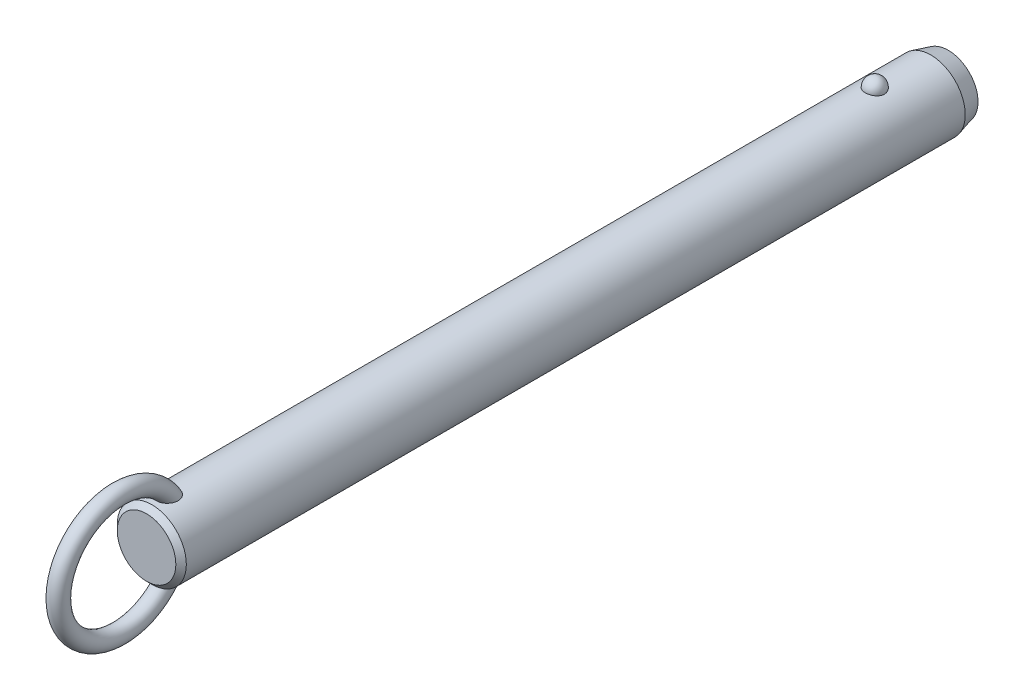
ISO-10303-21;
HEADER;
FILE_DESCRIPTION(('STEP AP214'),'2;1');
FILE_NAME('part.step','',(''),(''),'','','');
FILE_SCHEMA(('AUTOMOTIVE_DESIGN { 1 0 10303 214 1 1 1 1 }'));
ENDSEC;
DATA;
#1=APPLICATION_CONTEXT('core data for automotive mechanical design processes');
#2=APPLICATION_PROTOCOL_DEFINITION('international standard','automotive_design',2000,#1);
#3=PRODUCT_CONTEXT('',#1,'mechanical');
#4=PRODUCT('Part','Part','',(#3));
#5=PRODUCT_RELATED_PRODUCT_CATEGORY('part','',(#4));
#6=PRODUCT_DEFINITION_FORMATION('','',#4);
#7=PRODUCT_DEFINITION_CONTEXT('part definition',#1,'design');
#8=PRODUCT_DEFINITION('design','',#6,#7);
#9=PRODUCT_DEFINITION_SHAPE('','',#8);
#10=(LENGTH_UNIT() NAMED_UNIT(*) SI_UNIT(.MILLI.,.METRE.));
#11=(NAMED_UNIT(*) PLANE_ANGLE_UNIT() SI_UNIT($,.RADIAN.));
#12=(NAMED_UNIT(*) SI_UNIT($,.STERADIAN.) SOLID_ANGLE_UNIT());
#13=UNCERTAINTY_MEASURE_WITH_UNIT(LENGTH_MEASURE(1.E-05),#10,'distance_accuracy_value','');
#14=(GEOMETRIC_REPRESENTATION_CONTEXT(3) GLOBAL_UNCERTAINTY_ASSIGNED_CONTEXT((#13)) GLOBAL_UNIT_ASSIGNED_CONTEXT((#10,
#11,#12)) REPRESENTATION_CONTEXT('',''));
#15=CARTESIAN_POINT('',(0.,0.,0.));
#16=DIRECTION('',(0.,0.,1.));
#17=DIRECTION('',(1.,0.,0.));
#18=AXIS2_PLACEMENT_3D('',#15,#16,#17);
#19=CARTESIAN_POINT('',(0.,0.,154.9));
#20=DIRECTION('',(0.,0.,-1.));
#21=DIRECTION('',(-1.,0.,0.));
#22=AXIS2_PLACEMENT_3D('',#19,#20,#21);
#23=CYLINDRICAL_SURFACE('',#22,7.9);
#24=CARTESIAN_POINT('',(2.1785689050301,7.59367088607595,-2.20000000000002));
#25=CARTESIAN_POINT('',(2.17856679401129,7.59367269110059,-2.07701843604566));
#26=CARTESIAN_POINT('',(2.16853481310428,7.59657145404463,-1.95401006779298));
#27=CARTESIAN_POINT('',(2.12864689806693,7.607843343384,-1.71147811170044));
#28=CARTESIAN_POINT('',(2.09878338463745,7.61621856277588,-1.5919558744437));
#29=CARTESIAN_POINT('',(2.0199931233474,7.63749180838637,-1.35985638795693));
#30=CARTESIAN_POINT('',(1.97107475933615,7.6503878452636,-1.24727610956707));
#31=CARTESIAN_POINT('',(1.85539377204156,7.67926115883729,-1.03213234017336));
#32=CARTESIAN_POINT('',(1.78863158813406,7.69523835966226,-0.929568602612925));
#33=CARTESIAN_POINT('',(1.63856494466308,7.7285848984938,-0.73678633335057));
#34=CARTESIAN_POINT('',(1.55518140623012,7.7459606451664,-0.646630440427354));
#35=CARTESIAN_POINT('',(1.37422937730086,7.78009978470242,-0.481747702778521));
#36=CARTESIAN_POINT('',(1.27666086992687,7.79686317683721,-0.407020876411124));
#37=CARTESIAN_POINT('',(1.07024728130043,7.82786153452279,-0.275278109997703));
#38=CARTESIAN_POINT('',(0.961434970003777,7.84210353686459,-0.218212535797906));
#39=CARTESIAN_POINT('',(0.735351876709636,7.86652194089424,-0.123146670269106));
#40=CARTESIAN_POINT('',(0.618082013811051,7.87669878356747,-0.0851443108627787));
#41=CARTESIAN_POINT('',(0.380637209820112,7.89170521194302,-0.0298158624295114));
#42=CARTESIAN_POINT('',(0.260550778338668,7.89662650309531,-0.0121347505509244));
#43=CARTESIAN_POINT('',(0.0190117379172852,7.90090003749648,0.00324379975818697));
#44=CARTESIAN_POINT('',(-0.102440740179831,7.90025280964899,0.000943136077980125));
#45=CARTESIAN_POINT('',(-0.341452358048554,7.89351056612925,-0.0233955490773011));
#46=CARTESIAN_POINT('',(-0.459042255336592,7.88749257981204,-0.0451545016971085));
#47=CARTESIAN_POINT('',(-0.688796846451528,7.87075812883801,-0.107408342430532));
#48=CARTESIAN_POINT('',(-0.800961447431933,7.86004158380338,-0.14790355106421));
#49=CARTESIAN_POINT('',(-1.01743634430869,7.83497131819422,-0.246799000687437));
#50=CARTESIAN_POINT('',(-1.12169791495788,7.82059709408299,-0.305300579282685));
#51=CARTESIAN_POINT('',(-1.31891765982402,7.78976470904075,-0.43854939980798));
#52=CARTESIAN_POINT('',(-1.41187469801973,7.77330633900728,-0.513298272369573));
#53=CARTESIAN_POINT('',(-1.58577142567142,7.73972434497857,-0.678622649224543));
#54=CARTESIAN_POINT('',(-1.66645140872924,7.72259402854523,-0.769470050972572));
#55=CARTESIAN_POINT('',(-1.81161503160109,7.68983776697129,-0.963538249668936));
#56=CARTESIAN_POINT('',(-1.87609753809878,7.6742119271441,-1.0667599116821));
#57=CARTESIAN_POINT('',(-1.98790138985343,7.6460202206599,-1.28401170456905));
#58=CARTESIAN_POINT('',(-2.03501994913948,7.63349104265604,-1.39815107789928));
#59=CARTESIAN_POINT('',(-2.10986724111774,7.6131449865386,-1.6330178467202));
#60=CARTESIAN_POINT('',(-2.1375965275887,7.60532797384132,-1.75374505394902));
#61=CARTESIAN_POINT('',(-2.17289256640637,7.5953195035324,-1.99782562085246));
#62=CARTESIAN_POINT('',(-2.18054294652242,7.59310471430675,-2.12116592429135));
#63=CARTESIAN_POINT('',(-2.17572919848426,7.59448538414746,-2.36741799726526));
#64=CARTESIAN_POINT('',(-2.1632656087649,7.59808068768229,-2.49032977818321));
#65=CARTESIAN_POINT('',(-2.11865035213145,7.61064035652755,-2.73161015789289));
#66=CARTESIAN_POINT('',(-2.08659579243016,7.61957823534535,-2.84999812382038));
#67=CARTESIAN_POINT('',(-2.00367799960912,7.64179982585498,-3.07955956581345));
#68=CARTESIAN_POINT('',(-1.9528140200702,7.65508371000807,-3.19073275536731));
#69=CARTESIAN_POINT('',(-1.83321113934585,7.68460381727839,-3.40337899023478));
#70=CARTESIAN_POINT('',(-1.76437735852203,7.70085556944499,-3.5047965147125));
#71=CARTESIAN_POINT('',(-1.61069526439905,7.73445734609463,-3.69446912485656));
#72=CARTESIAN_POINT('',(-1.52584634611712,7.75180741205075,-3.78272371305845));
#73=CARTESIAN_POINT('',(-1.34198059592,7.78574608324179,-3.94393987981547));
#74=CARTESIAN_POINT('',(-1.24291308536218,7.80233167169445,-4.01684434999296));
#75=CARTESIAN_POINT('',(-1.03352039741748,7.83281625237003,-4.14489386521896));
#76=CARTESIAN_POINT('',(-0.92319600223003,7.84671543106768,-4.20004014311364));
#77=CARTESIAN_POINT('',(-0.695822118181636,7.87011575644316,-4.29042017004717));
#78=CARTESIAN_POINT('',(-0.578872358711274,7.87966903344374,-4.32589112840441));
#79=CARTESIAN_POINT('',(-0.340410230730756,7.8935652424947,-4.37692226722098));
#80=CARTESIAN_POINT('',(-0.218898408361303,7.89790879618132,-4.39248482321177));
#81=CARTESIAN_POINT('',(0.0228107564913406,7.90087453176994,-4.40314405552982));
#82=CARTESIAN_POINT('',(0.142990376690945,7.89960185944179,-4.39861683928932));
#83=CARTESIAN_POINT('',(0.380829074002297,7.89171262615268,-4.37008293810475));
#84=CARTESIAN_POINT('',(0.498488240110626,7.8850962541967,-4.34607694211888));
#85=CARTESIAN_POINT('',(0.727535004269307,7.86726442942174,-4.27939317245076));
#86=CARTESIAN_POINT('',(0.838944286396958,7.85606616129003,-4.23678512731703));
#87=CARTESIAN_POINT('',(1.05295421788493,7.83025654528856,-4.13408348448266));
#88=CARTESIAN_POINT('',(1.15555431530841,7.81564498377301,-4.07398879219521));
#89=CARTESIAN_POINT('',(1.35076763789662,7.7843022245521,-3.93687432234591));
#90=CARTESIAN_POINT('',(1.4432046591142,7.76754209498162,-3.85961036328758));
#91=CARTESIAN_POINT('',(1.6139111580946,7.73387857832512,-3.69076949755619));
#92=CARTESIAN_POINT('',(1.6921781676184,7.71697516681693,-3.59919010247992));
#93=CARTESIAN_POINT('',(1.83380875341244,7.6845643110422,-3.40247278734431));
#94=CARTESIAN_POINT('',(1.89689280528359,7.66908588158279,-3.29712873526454));
#95=CARTESIAN_POINT('',(2.0047823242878,7.64159441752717,-3.07707931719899));
#96=CARTESIAN_POINT('',(2.0495945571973,7.62958010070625,-2.96237743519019));
#97=CARTESIAN_POINT('',(2.11580183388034,7.61146617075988,-2.74040519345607));
#98=CARTESIAN_POINT('',(2.13929812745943,7.60484503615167,-2.63379846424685));
#99=CARTESIAN_POINT('',(2.17068242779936,7.59594664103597,-2.4181348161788));
#100=CARTESIAN_POINT('',(2.17857077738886,7.59366928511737,-2.30907795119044));
#101=CARTESIAN_POINT('',(2.1785689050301,7.59367088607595,-2.20000000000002));
#102=B_SPLINE_CURVE_WITH_KNOTS('',3,(#24,#25,#26,#27,#28,#29,#30,#31,#32,#33,#34,#35,#36,#37,
#38,#39,#40,#41,#42,#43,#44,#45,#46,#47,#48,#49,#50,#51,#52,#53,#54,#55,#56,#57,#58,#59,#60,#61,
#62,#63,#64,#65,#66,#67,#68,#69,#70,#71,#72,#73,#74,#75,#76,#77,#78,#79,#80,#81,#82,#83,#84,#85,
#86,#87,#88,#89,#90,#91,#92,#93,#94,#95,#96,#97,#98,#99,#100,#101),.UNSPECIFIED.,.T.,.F.,(4,2,2,
2,2,2,2,2,2,2,2,2,2,2,2,2,2,2,2,2,2,2,2,2,2,2,2,2,2,2,2,2,2,2,2,2,2,2,4),(0.,0.368552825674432,
0.737246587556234,1.10577831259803,1.4743009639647,1.8446206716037,2.21494081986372,
2.5842105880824,2.95344028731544,3.31611630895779,3.67875788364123,4.03628044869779,
4.39380913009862,4.75338791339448,5.11300280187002,5.47939989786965,5.8458226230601,
6.21639834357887,6.58696347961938,6.95598276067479,7.32499216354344,7.69218715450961,
8.0593967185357,8.42858578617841,8.79778880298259,9.16834203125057,9.5388695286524,
9.90482699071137,10.2707407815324,10.6298333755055,10.9889132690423,11.3466585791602,
11.7044262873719,12.0676511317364,12.4309391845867,12.8004764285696,13.1698767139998,
13.4967701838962,13.8236564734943),.UNSPECIFIED.);
#103=CARTESIAN_POINT('',(2.1785689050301,7.59367088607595,-2.20000000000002));
#104=VERTEX_POINT('',#103);
#105=EDGE_CURVE('E41',#104,#104,#102,.T.);
#106=ORIENTED_EDGE('',*,*,#105,.T.);
#107=EDGE_LOOP('',(#106));
#108=FACE_BOUND('',#107,.T.);
#109=CARTESIAN_POINT('',(0.,0.,163.22));
#110=DIRECTION('',(0.,0.,1.));
#111=DIRECTION('',(1.,0.,0.));
#112=AXIS2_PLACEMENT_3D('',#109,#110,#111);
#113=CIRCLE('',#112,7.9);
#114=CARTESIAN_POINT('',(7.9,0.,163.22));
#115=VERTEX_POINT('',#114);
#116=EDGE_CURVE('E10',#115,#115,#113,.F.);
#117=ORIENTED_EDGE('',*,*,#116,.T.);
#118=EDGE_LOOP('',(#117));
#119=FACE_BOUND('',#118,.T.);
#120=CARTESIAN_POINT('',(-0.630969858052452,-7.87476203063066,157.112432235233));
#121=CARTESIAN_POINT('',(-0.734180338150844,-7.86648998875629,157.147285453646));
#122=CARTESIAN_POINT('',(-0.834476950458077,-7.85639291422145,157.190816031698));
#123=CARTESIAN_POINT('',(-1.0262035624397,-7.83366343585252,157.294094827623));
#124=CARTESIAN_POINT('',(-1.1176141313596,-7.82102565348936,157.353877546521));
#125=CARTESIAN_POINT('',(-1.28877277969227,-7.79464922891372,157.487839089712));
#126=CARTESIAN_POINT('',(-1.36854014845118,-7.78091246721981,157.561993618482));
#127=CARTESIAN_POINT('',(-1.51461521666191,-7.75380398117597,157.722494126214));
#128=CARTESIAN_POINT('',(-1.58092966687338,-7.74043207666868,157.808833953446));
#129=CARTESIAN_POINT('',(-1.70019064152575,-7.7151252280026,157.992978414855));
#130=CARTESIAN_POINT('',(-1.75284037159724,-7.70322473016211,158.090979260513));
#131=CARTESIAN_POINT('',(-1.84263464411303,-7.68224112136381,158.294102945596));
#132=CARTESIAN_POINT('',(-1.87977299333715,-7.6731591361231,158.399228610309));
#133=CARTESIAN_POINT('',(-1.94152728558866,-7.65777930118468,158.623284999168));
#134=CARTESIAN_POINT('',(-1.96475471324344,-7.65179654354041,158.742616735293));
#135=CARTESIAN_POINT('',(-1.99449499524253,-7.64409642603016,158.98342986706));
#136=CARTESIAN_POINT('',(-2.0010005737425,-7.64238092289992,159.104912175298));
#137=CARTESIAN_POINT('',(-1.99856014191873,-7.64302120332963,159.368340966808));
#138=CARTESIAN_POINT('',(-1.98680021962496,-7.64611845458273,159.51025654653));
#139=CARTESIAN_POINT('',(-1.94457772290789,-7.65696186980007,159.791118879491));
#140=CARTESIAN_POINT('',(-1.91409393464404,-7.66471330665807,159.930062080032));
#141=CARTESIAN_POINT('',(-1.82768670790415,-7.68582947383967,160.231939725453));
#142=CARTESIAN_POINT('',(-1.76772963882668,-7.70003779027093,160.393686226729));
#143=CARTESIAN_POINT('',(-1.65998501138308,-7.72371550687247,160.627695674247));
#144=CARTESIAN_POINT('',(-1.62107967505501,-7.73200670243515,160.704297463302));
#145=CARTESIAN_POINT('',(-1.53727726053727,-7.74910377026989,160.854079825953));
#146=CARTESIAN_POINT('',(-1.49238215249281,-7.75790947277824,160.927261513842));
#147=CARTESIAN_POINT('',(-1.37397050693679,-7.77993338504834,161.10288382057));
#148=CARTESIAN_POINT('',(-1.29690364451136,-7.79328473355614,161.202955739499));
#149=CARTESIAN_POINT('',(-1.1288548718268,-7.81939266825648,161.390714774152));
#150=CARTESIAN_POINT('',(-1.03789926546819,-7.83215032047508,161.478424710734));
#151=CARTESIAN_POINT('',(-0.869532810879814,-7.85231710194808,161.613414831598));
#152=CARTESIAN_POINT('',(-0.795716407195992,-7.86021093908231,161.665076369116));
#153=CARTESIAN_POINT('',(-0.640813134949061,-7.87434920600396,161.756381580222));
#154=CARTESIAN_POINT('',(-0.559737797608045,-7.88059619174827,161.79604389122));
#155=CARTESIAN_POINT('',(-0.406456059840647,-7.88984116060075,161.854300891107));
#156=CARTESIAN_POINT('',(-0.335227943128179,-7.89321892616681,161.875384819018));
#157=CARTESIAN_POINT('',(-0.190193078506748,-7.89804235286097,161.90541418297));
#158=CARTESIAN_POINT('',(-0.11638863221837,-7.89948969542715,161.914370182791));
#159=CARTESIAN_POINT('',(0.0318414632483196,-7.90028409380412,161.919291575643));
#160=CARTESIAN_POINT('',(0.106268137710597,-7.89962640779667,161.915227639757));
#161=CARTESIAN_POINT('',(0.253290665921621,-7.8962818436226,161.894461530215));
#162=CARTESIAN_POINT('',(0.325885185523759,-7.8935935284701,161.877750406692));
#163=CARTESIAN_POINT('',(0.481441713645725,-7.88577340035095,161.828738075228));
#164=CARTESIAN_POINT('',(0.563611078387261,-7.88026321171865,161.794005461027));
#165=CARTESIAN_POINT('',(0.721129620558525,-7.86741729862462,161.711796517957));
#166=CARTESIAN_POINT('',(0.796466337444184,-7.86007832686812,161.664297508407));
#167=CARTESIAN_POINT('',(0.971456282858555,-7.84073285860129,161.536513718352));
#168=CARTESIAN_POINT('',(1.06719686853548,-7.82809461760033,161.451004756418));
#169=CARTESIAN_POINT('',(1.24418921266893,-7.80192439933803,161.266232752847));
#170=CARTESIAN_POINT('',(1.32540832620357,-7.78839049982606,161.166939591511));
#171=CARTESIAN_POINT('',(1.45199971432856,-7.76559693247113,160.989576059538));
#172=CARTESIAN_POINT('',(1.50085649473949,-7.75626094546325,160.913954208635));
#173=CARTESIAN_POINT('',(1.59197749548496,-7.7380727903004,160.758742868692));
#174=CARTESIAN_POINT('',(1.63423919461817,-7.72922080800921,160.679151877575));
#175=CARTESIAN_POINT('',(1.71222612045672,-7.71231959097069,160.516664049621));
#176=CARTESIAN_POINT('',(1.74794516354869,-7.70427111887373,160.433764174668));
#177=CARTESIAN_POINT('',(1.81270113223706,-7.68929240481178,160.265296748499));
#178=CARTESIAN_POINT('',(1.84173789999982,-7.68236218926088,160.179729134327));
#179=CARTESIAN_POINT('',(1.89322698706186,-7.6698375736,160.00528702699));
#180=CARTESIAN_POINT('',(1.91558744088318,-7.66426199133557,159.916383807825));
#181=CARTESIAN_POINT('',(1.95281367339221,-7.65485915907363,159.736969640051));
#182=CARTESIAN_POINT('',(1.96767946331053,-7.65103190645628,159.646458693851));
#183=CARTESIAN_POINT('',(2.00021456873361,-7.64262981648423,159.373732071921));
#184=CARTESIAN_POINT('',(2.00600691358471,-7.6410871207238,159.189709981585));
#185=CARTESIAN_POINT('',(1.98445334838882,-7.64669564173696,158.876501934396));
#186=CARTESIAN_POINT('',(1.96607186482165,-7.65149688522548,158.746618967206));
#187=CARTESIAN_POINT('',(1.90884967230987,-7.6659762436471,158.491632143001));
#188=CARTESIAN_POINT('',(1.87002101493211,-7.67565148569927,158.366525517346));
#189=CARTESIAN_POINT('',(1.77063986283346,-7.69918471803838,158.12454013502));
#190=CARTESIAN_POINT('',(1.70993724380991,-7.71307150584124,158.007725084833));
#191=CARTESIAN_POINT('',(1.56733070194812,-7.74330306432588,157.788144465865));
#192=CARTESIAN_POINT('',(1.48543692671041,-7.75964665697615,157.685372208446));
#193=CARTESIAN_POINT('',(1.31346177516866,-7.79047523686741,157.509380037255));
#194=CARTESIAN_POINT('',(1.22547278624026,-7.80495298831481,157.434106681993));
#195=CARTESIAN_POINT('',(1.0372435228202,-7.83218597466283,157.300486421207));
#196=CARTESIAN_POINT('',(0.937008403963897,-7.84494192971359,157.242132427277));
#197=CARTESIAN_POINT('',(0.73359933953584,-7.86649045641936,157.147027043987));
#198=CARTESIAN_POINT('',(0.630941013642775,-7.87547134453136,157.109210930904));
#199=CARTESIAN_POINT('',(0.420465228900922,-7.88950708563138,157.051116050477));
#200=CARTESIAN_POINT('',(0.312645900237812,-7.89456050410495,157.03084369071));
#201=CARTESIAN_POINT('',(0.0960869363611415,-7.9001518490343,157.008455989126));
#202=CARTESIAN_POINT('',(-0.012634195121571,-7.90073226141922,157.006169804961));
#203=CARTESIAN_POINT('',(-0.228766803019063,-7.89742350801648,157.019367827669));
#204=CARTESIAN_POINT('',(-0.336180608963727,-7.89354403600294,157.034813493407));
#205=CARTESIAN_POINT('',(-0.473410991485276,-7.88586871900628,157.066217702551));
#206=CARTESIAN_POINT('',(-0.505257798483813,-7.88388984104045,157.074354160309));
#207=CARTESIAN_POINT('',(-0.568481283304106,-7.87958326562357,157.092208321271));
#208=CARTESIAN_POINT('',(-0.599857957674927,-7.87725556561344,157.101926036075));
#209=CARTESIAN_POINT('',(-0.630969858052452,-7.87476203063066,157.112432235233));
#210=B_SPLINE_CURVE_WITH_KNOTS('',3,(#120,#121,#122,#123,#124,#125,#126,#127,#128,#129,#130,
#131,#132,#133,#134,#135,#136,#137,#138,#139,#140,#141,#142,#143,#144,#145,#146,#147,#148,#149,
#150,#151,#152,#153,#154,#155,#156,#157,#158,#159,#160,#161,#162,#163,#164,#165,#166,#167,#168,
#169,#170,#171,#172,#173,#174,#175,#176,#177,#178,#179,#180,#181,#182,#183,#184,#185,#186,#187,
#188,#189,#190,#191,#192,#193,#194,#195,#196,#197,#198,#199,#200,#201,#202,#203,#204,#205,#206,
#207,#208,#209),.UNSPECIFIED.,.T.,.F.,(4,2,2,2,2,2,2,2,2,2,2,2,2,2,2,2,2,2,2,2,2,2,2,2,2,2,2,2,
2,2,2,2,2,2,2,2,2,2,2,2,2,2,2,2,4),(0.,0.327622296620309,0.655945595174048,0.983718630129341,
1.3113267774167,1.64554655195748,1.97989964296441,2.34365728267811,2.70757317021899,
3.13333684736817,3.55958380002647,4.07655306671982,4.33527897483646,4.59391999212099,
4.97382437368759,5.353017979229,5.62348245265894,5.89352465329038,6.11565959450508,
6.33760092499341,6.56004255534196,6.78264174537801,7.0493084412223,7.31645206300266,
7.70130871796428,8.08701995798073,8.35824509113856,8.62957365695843,8.9011573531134,
9.1727474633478,9.44791855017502,9.72308922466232,10.2715298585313,10.6638393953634,
11.0559179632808,11.4507403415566,11.8453740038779,12.1936425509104,12.5417649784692,
12.8695063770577,13.1973674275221,13.5221104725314,13.8461490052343,13.9449071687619,
14.0436660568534),.UNSPECIFIED.);
#211=CARTESIAN_POINT('',(-0.630969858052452,-7.87476203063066,157.112432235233));
#212=VERTEX_POINT('',#211);
#213=EDGE_CURVE('E60',#212,#212,#210,.T.);
#214=ORIENTED_EDGE('',*,*,#213,.T.);
#215=EDGE_LOOP('',(#214));
#216=FACE_BOUND('',#215,.T.);
#217=CARTESIAN_POINT('',(-0.630969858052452,7.87476203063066,157.112432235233));
#218=CARTESIAN_POINT('',(-0.52891882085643,7.88293636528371,157.077979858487));
#219=CARTESIAN_POINT('',(-0.423745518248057,7.88934810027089,157.051915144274));
#220=CARTESIAN_POINT('',(-0.210236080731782,7.8979273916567,157.017282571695));
#221=CARTESIAN_POINT('',(-0.101893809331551,7.90008607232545,157.008751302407));
#222=CARTESIAN_POINT('',(0.11466056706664,7.89990877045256,157.009457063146));
#223=CARTESIAN_POINT('',(0.222872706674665,7.89757640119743,157.01867980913));
#224=CARTESIAN_POINT('',(0.436107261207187,7.88867538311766,157.054652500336));
#225=CARTESIAN_POINT('',(0.541131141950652,7.8821087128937,157.08139425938));
#226=CARTESIAN_POINT('',(0.745085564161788,7.86545130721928,157.151756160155));
#227=CARTESIAN_POINT('',(0.844015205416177,7.85536005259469,157.195378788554));
#228=CARTESIAN_POINT('',(1.03299167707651,7.83275153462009,157.298379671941));
#229=CARTESIAN_POINT('',(1.12303841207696,7.8202342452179,157.357758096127));
#230=CARTESIAN_POINT('',(1.29214734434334,7.79408219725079,157.490864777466));
#231=CARTESIAN_POINT('',(1.37116907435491,7.78044359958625,157.564643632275));
#232=CARTESIAN_POINT('',(1.51597677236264,7.75353170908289,157.724235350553));
#233=CARTESIAN_POINT('',(1.58176261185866,7.74025841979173,157.810048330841));
#234=CARTESIAN_POINT('',(1.70057386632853,7.71504069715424,157.993644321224));
#235=CARTESIAN_POINT('',(1.75320073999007,7.7031425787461,158.091690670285));
#236=CARTESIAN_POINT('',(1.8429376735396,7.68216822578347,158.294893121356));
#237=CARTESIAN_POINT('',(1.88004278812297,7.67309289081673,158.400051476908));
#238=CARTESIAN_POINT('',(1.9417232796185,7.6577294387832,158.624167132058));
#239=CARTESIAN_POINT('',(1.96491037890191,7.65175648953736,158.743524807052));
#240=CARTESIAN_POINT('',(1.9945689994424,7.64407702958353,158.984384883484));
#241=CARTESIAN_POINT('',(2.00103304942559,7.64237242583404,159.10588821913));
#242=CARTESIAN_POINT('',(1.99850166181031,7.64303650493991,159.369368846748));
#243=CARTESIAN_POINT('',(1.98669038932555,7.64614714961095,159.511314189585));
#244=CARTESIAN_POINT('',(1.94436120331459,7.6570170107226,159.792228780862));
#245=CARTESIAN_POINT('',(1.91382203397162,7.66478150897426,159.931194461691));
#246=CARTESIAN_POINT('',(1.82728754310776,7.68592483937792,160.233111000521));
#247=CARTESIAN_POINT('',(1.76725778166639,7.7001468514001,160.394872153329));
#248=CARTESIAN_POINT('',(1.65939700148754,7.72384204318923,160.628891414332));
#249=CARTESIAN_POINT('',(1.62045187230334,7.73213852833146,160.705494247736));
#250=CARTESIAN_POINT('',(1.53656684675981,7.74924489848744,160.855273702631));
#251=CARTESIAN_POINT('',(1.49162892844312,7.75805461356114,160.928451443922));
#252=CARTESIAN_POINT('',(1.37317698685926,7.78007342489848,161.103952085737));
#253=CARTESIAN_POINT('',(1.29612360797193,7.79341423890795,161.203911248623));
#254=CARTESIAN_POINT('',(1.12812043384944,7.81949839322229,161.39145083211));
#255=CARTESIAN_POINT('',(1.03719688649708,7.83224280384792,161.479054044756));
#256=CARTESIAN_POINT('',(0.868871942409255,7.85239026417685,161.61389715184));
#257=CARTESIAN_POINT('',(0.795056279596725,7.86027769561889,161.665511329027));
#258=CARTESIAN_POINT('',(0.640160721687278,7.87440222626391,161.756720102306));
#259=CARTESIAN_POINT('',(0.55909234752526,7.88064188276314,161.796333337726));
#260=CARTESIAN_POINT('',(0.405820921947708,7.8898738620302,161.854505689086));
#261=CARTESIAN_POINT('',(0.334594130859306,7.89324577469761,161.875552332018));
#262=CARTESIAN_POINT('',(0.189568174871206,7.89805733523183,161.905507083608));
#263=CARTESIAN_POINT('',(0.115771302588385,7.89949866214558,161.914425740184));
#264=CARTESIAN_POINT('',(-0.0324359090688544,7.90028156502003,161.91927589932));
#265=CARTESIAN_POINT('',(-0.106847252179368,7.89961843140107,161.915178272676));
#266=CARTESIAN_POINT('',(-0.253834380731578,7.8962642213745,161.894351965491));
#267=CARTESIAN_POINT('',(-0.326408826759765,7.89357170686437,161.877614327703));
#268=CARTESIAN_POINT('',(-0.481962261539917,7.88574179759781,161.828539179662));
#269=CARTESIAN_POINT('',(-0.564145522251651,7.88022507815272,161.793763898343));
#270=CARTESIAN_POINT('',(-0.7216852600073,7.86736646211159,161.711468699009));
#271=CARTESIAN_POINT('',(-0.797029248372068,7.8600213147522,161.663926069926));
#272=CARTESIAN_POINT('',(-0.972044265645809,7.84066026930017,161.536026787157));
#273=CARTESIAN_POINT('',(-1.0677980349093,7.828012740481,161.450443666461));
#274=CARTESIAN_POINT('',(-1.24480531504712,7.80182621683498,161.265522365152));
#275=CARTESIAN_POINT('',(-1.32602618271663,7.78828530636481,161.166154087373));
#276=CARTESIAN_POINT('',(-1.4525983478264,7.76548487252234,160.988680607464));
#277=CARTESIAN_POINT('',(-1.50143856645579,7.75614818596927,160.913025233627));
#278=CARTESIAN_POINT('',(-1.59252410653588,7.73796020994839,160.757748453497));
#279=CARTESIAN_POINT('',(-1.63476690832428,7.729109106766,160.678125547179));
#280=CARTESIAN_POINT('',(-1.71271318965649,7.71221133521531,160.515575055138));
#281=CARTESIAN_POINT('',(-1.74841047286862,7.70416543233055,160.432644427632));
#282=CARTESIAN_POINT('',(-1.81311929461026,7.6891937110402,160.264116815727));
#283=CARTESIAN_POINT('',(-1.84213067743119,7.68226791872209,160.178519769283));
#284=CARTESIAN_POINT('',(-1.89356259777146,7.66975461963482,160.004025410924));
#285=CARTESIAN_POINT('',(-1.91589165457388,7.66418586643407,159.915099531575));
#286=CARTESIAN_POINT('',(-1.9530507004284,7.65479859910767,159.735642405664));
#287=CARTESIAN_POINT('',(-1.96788069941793,7.65098008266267,159.645111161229));
#288=CARTESIAN_POINT('',(-2.00030078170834,7.64260704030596,159.372327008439));
#289=CARTESIAN_POINT('',(-2.00600576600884,7.64108760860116,159.188271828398));
#290=CARTESIAN_POINT('',(-1.9842848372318,7.64673945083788,158.875080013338));
#291=CARTESIAN_POINT('',(-1.96583698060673,7.65155751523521,158.745240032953));
#292=CARTESIAN_POINT('',(-1.90848948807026,7.66606613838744,158.490361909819));
#293=CARTESIAN_POINT('',(-1.86960376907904,7.67575338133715,158.365320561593));
#294=CARTESIAN_POINT('',(-1.77013421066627,7.6993013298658,158.123500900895));
#295=CARTESIAN_POINT('',(-1.70940488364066,7.71318991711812,158.006784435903));
#296=CARTESIAN_POINT('',(-1.5667295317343,7.74342495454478,157.787340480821));
#297=CARTESIAN_POINT('',(-1.48478316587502,7.75977144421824,157.68461321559));
#298=CARTESIAN_POINT('',(-1.31266325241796,7.79061163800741,157.508643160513));
#299=CARTESIAN_POINT('',(-1.22456383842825,7.80509908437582,157.433358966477));
#300=CARTESIAN_POINT('',(-1.03622400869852,7.83231881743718,157.299865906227));
#301=CARTESIAN_POINT('',(-0.93601531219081,7.84505551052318,157.241613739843));
#302=CARTESIAN_POINT('',(-0.798824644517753,7.85957802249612,157.177540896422));
#303=CARTESIAN_POINT('',(-0.765787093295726,7.86286821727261,157.163224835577));
#304=CARTESIAN_POINT('',(-0.698939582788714,7.86909211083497,157.136436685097));
#305=CARTESIAN_POINT('',(-0.665129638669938,7.8720258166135,157.123964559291));
#306=CARTESIAN_POINT('',(-0.630969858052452,7.87476203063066,157.112432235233));
#307=B_SPLINE_CURVE_WITH_KNOTS('',3,(#217,#218,#219,#220,#221,#222,#223,#224,#225,#226,#227,
#228,#229,#230,#231,#232,#233,#234,#235,#236,#237,#238,#239,#240,#241,#242,#243,#244,#245,#246,
#247,#248,#249,#250,#251,#252,#253,#254,#255,#256,#257,#258,#259,#260,#261,#262,#263,#264,#265,
#266,#267,#268,#269,#270,#271,#272,#273,#274,#275,#276,#277,#278,#279,#280,#281,#282,#283,#284,
#285,#286,#287,#288,#289,#290,#291,#292,#293,#294,#295,#296,#297,#298,#299,#300,#301,#302,#303,
#304,#305,#306),.UNSPECIFIED.,.T.,.F.,(4,2,2,2,2,2,2,2,2,2,2,2,2,2,2,2,2,2,2,2,2,2,2,2,2,2,2,2,
2,2,2,2,2,2,2,2,2,2,2,2,2,2,2,2,4),(0.,0.32392037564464,0.648516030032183,0.972850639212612,
1.29703380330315,1.62126473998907,1.94549915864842,2.27089401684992,2.59629203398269,
2.93059633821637,3.26500707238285,3.6288164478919,3.99278833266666,4.41865421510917,
4.84500434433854,5.36209210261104,5.62087589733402,5.87957448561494,6.25918598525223,
6.63808782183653,6.90846748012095,7.17842501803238,7.40052350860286,7.62242871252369,
7.84483086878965,8.0673907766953,8.33414615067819,8.60137921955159,8.98641454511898,
9.37230415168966,9.64358673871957,9.91497268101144,10.1866142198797,10.4582620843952,
10.7334745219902,11.008686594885,11.5572126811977,11.9494246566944,12.3413699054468,
12.7359755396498,13.1305875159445,13.4791770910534,13.82687259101,13.9353013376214,
14.0437279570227),.UNSPECIFIED.);
#308=CARTESIAN_POINT('',(-0.630969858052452,7.87476203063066,157.112432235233));
#309=VERTEX_POINT('',#308);
#310=EDGE_CURVE('E67',#309,#309,#307,.T.);
#311=ORIENTED_EDGE('',*,*,#310,.T.);
#312=EDGE_LOOP('',(#311));
#313=FACE_BOUND('',#312,.T.);
#314=CARTESIAN_POINT('',(0.,0.,-14.9999999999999));
#315=DIRECTION('',(0.,0.,-1.));
#316=DIRECTION('',(-1.,0.,0.));
#317=AXIS2_PLACEMENT_3D('',#314,#315,#316);
#318=CIRCLE('',#317,7.9);
#319=CARTESIAN_POINT('',(-7.9,0.,-14.9999999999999));
#320=VERTEX_POINT('',#319);
#321=EDGE_CURVE('E57',#320,#320,#318,.F.);
#322=ORIENTED_EDGE('',*,*,#321,.T.);
#323=EDGE_LOOP('',(#322));
#324=FACE_BOUND('',#323,.T.);
#325=ADVANCED_FACE('F37',(#108,#119,#216,#313,#324),#23,.T.);
#326=CARTESIAN_POINT('',(0.,0.,-19.));
#327=DIRECTION('',(0.,0.,-1.));
#328=DIRECTION('',(-1.,0.,0.));
#329=AXIS2_PLACEMENT_3D('',#326,#327,#328);
#330=PLANE('',#329);
#331=CARTESIAN_POINT('',(0.,0.,-19.));
#332=DIRECTION('',(0.,0.,-1.));
#333=DIRECTION('',(-1.,0.,0.));
#334=AXIS2_PLACEMENT_3D('',#331,#332,#333);
#335=CIRCLE('',#334,6.8282032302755);
#336=CARTESIAN_POINT('',(-6.8282032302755,0.,-19.));
#337=VERTEX_POINT('',#336);
#338=EDGE_CURVE('E66',#337,#337,#335,.T.);
#339=ORIENTED_EDGE('',*,*,#338,.T.);
#340=EDGE_LOOP('',(#339));
#341=FACE_BOUND('',#340,.T.);
#342=ADVANCED_FACE('F85',(#341),#330,.T.);
#343=CARTESIAN_POINT('',(0.,0.,-19.));
#344=DIRECTION('',(0.,0.,1.));
#345=DIRECTION('',(1.,0.,0.));
#346=AXIS2_PLACEMENT_3D('',#343,#344,#345);
#347=CONICAL_SURFACE('',#346,6.8282032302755,0.261799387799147);
#348=ORIENTED_EDGE('',*,*,#321,.F.);
#349=EDGE_LOOP('',(#348));
#350=FACE_BOUND('',#349,.T.);
#351=ORIENTED_EDGE('',*,*,#338,.F.);
#352=EDGE_LOOP('',(#351));
#353=FACE_BOUND('',#352,.T.);
#354=ADVANCED_FACE('F83',(#350,#353),#347,.T.);
#355=CARTESIAN_POINT('',(0.,0.,164.42));
#356=DIRECTION('',(0.,0.,1.));
#357=DIRECTION('',(1.,0.,0.));
#358=AXIS2_PLACEMENT_3D('',#355,#356,#357);
#359=PLANE('',#358);
#360=CARTESIAN_POINT('',(0.,0.,164.42));
#361=DIRECTION('',(0.,0.,1.));
#362=DIRECTION('',(1.,0.,0.));
#363=AXIS2_PLACEMENT_3D('',#360,#361,#362);
#364=CIRCLE('',#363,6.69999999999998);
#365=CARTESIAN_POINT('',(6.69999999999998,0.,164.42));
#366=VERTEX_POINT('',#365);
#367=EDGE_CURVE('E50',#366,#366,#364,.T.);
#368=ORIENTED_EDGE('',*,*,#367,.T.);
#369=EDGE_LOOP('',(#368));
#370=FACE_BOUND('',#369,.T.);
#371=ADVANCED_FACE('F77',(#370),#359,.T.);
#372=CARTESIAN_POINT('',(0.,0.,170.75));
#373=DIRECTION('',(1.,0.,0.));
#374=DIRECTION('',(0.,0.,-1.));
#375=AXIS2_PLACEMENT_3D('',#372,#373,#374);
#376=TOROIDAL_SURFACE('',#375,13.85,2.);
#377=ORIENTED_EDGE('',*,*,#310,.F.);
#378=EDGE_LOOP('',(#377));
#379=FACE_BOUND('',#378,.T.);
#380=ORIENTED_EDGE('',*,*,#213,.F.);
#381=EDGE_LOOP('',(#380));
#382=FACE_BOUND('',#381,.T.);
#383=ADVANCED_FACE('F73',(#379,#382),#376,.T.);
#384=CARTESIAN_POINT('',(0.,0.,164.42));
#385=DIRECTION('',(0.,0.,-1.));
#386=DIRECTION('',(-1.,0.,0.));
#387=AXIS2_PLACEMENT_3D('',#384,#385,#386);
#388=CONICAL_SURFACE('',#387,6.69999999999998,0.785398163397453);
#389=ORIENTED_EDGE('',*,*,#116,.F.);
#390=EDGE_LOOP('',(#389));
#391=FACE_BOUND('',#390,.T.);
#392=ORIENTED_EDGE('',*,*,#367,.F.);
#393=EDGE_LOOP('',(#392));
#394=FACE_BOUND('',#393,.T.);
#395=ADVANCED_FACE('F39',(#391,#394),#388,.T.);
#396=CARTESIAN_POINT('',(0.,7.9,-2.20000000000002));
#397=DIRECTION('',(0.,1.,0.));
#398=DIRECTION('',(0.,0.,-1.));
#399=AXIS2_PLACEMENT_3D('',#396,#397,#398);
#400=SPHERICAL_SURFACE('',#399,2.2);
#401=ORIENTED_EDGE('',*,*,#105,.F.);
#402=EDGE_LOOP('',(#401));
#403=FACE_BOUND('',#402,.T.);
#404=ADVANCED_FACE('F79',(#403),#400,.T.);
#405=CLOSED_SHELL('',(#325,#342,#354,#371,#383,#395,#404));
#406=MANIFOLD_SOLID_BREP('B2',#405);
#407=ADVANCED_BREP_SHAPE_REPRESENTATION('',(#18,#406),#14);
#408=SHAPE_DEFINITION_REPRESENTATION(#9,#407);
ENDSEC;
END-ISO-10303-21;
